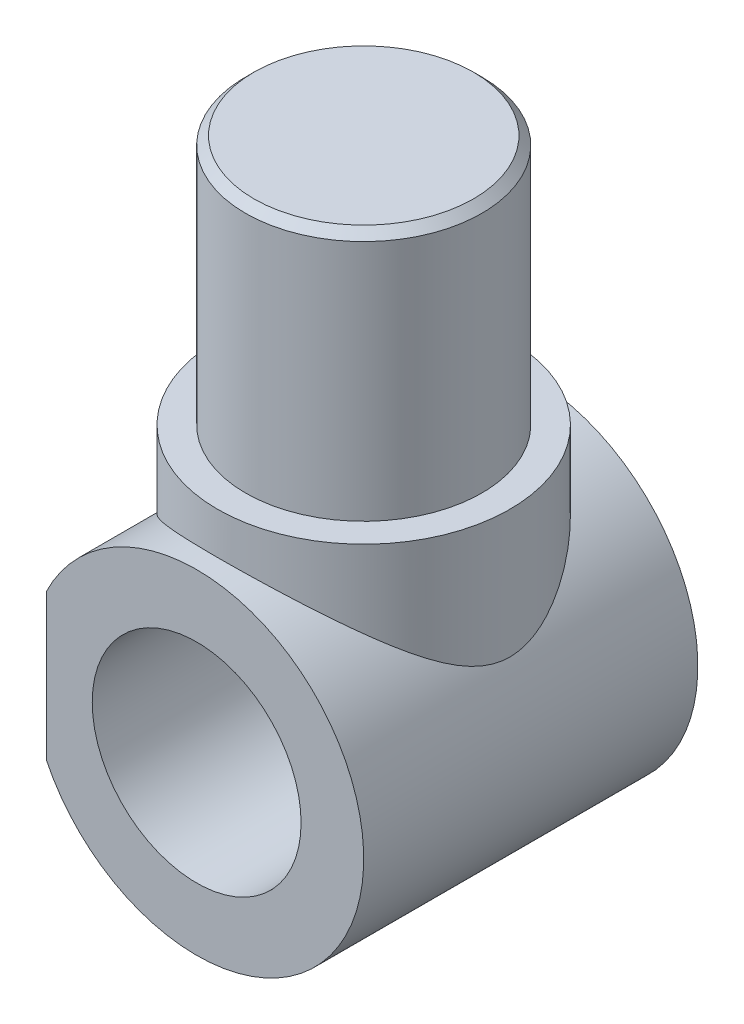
ISO-10303-21;
HEADER;
FILE_DESCRIPTION(('STEP AP214'),'2;1');
FILE_NAME('part.step','',(''),(''),'','','');
FILE_SCHEMA(('AUTOMOTIVE_DESIGN { 1 0 10303 214 1 1 1 1 }'));
ENDSEC;
DATA;
#1=APPLICATION_CONTEXT('core data for automotive mechanical design processes');
#2=APPLICATION_PROTOCOL_DEFINITION('international standard','automotive_design',2000,#1);
#3=PRODUCT_CONTEXT('',#1,'mechanical');
#4=PRODUCT('Part','Part','',(#3));
#5=PRODUCT_RELATED_PRODUCT_CATEGORY('part','',(#4));
#6=PRODUCT_DEFINITION_FORMATION('','',#4);
#7=PRODUCT_DEFINITION_CONTEXT('part definition',#1,'design');
#8=PRODUCT_DEFINITION('design','',#6,#7);
#9=PRODUCT_DEFINITION_SHAPE('','',#8);
#10=(LENGTH_UNIT() NAMED_UNIT(*) SI_UNIT(.MILLI.,.METRE.));
#11=(NAMED_UNIT(*) PLANE_ANGLE_UNIT() SI_UNIT($,.RADIAN.));
#12=(NAMED_UNIT(*) SI_UNIT($,.STERADIAN.) SOLID_ANGLE_UNIT());
#13=UNCERTAINTY_MEASURE_WITH_UNIT(LENGTH_MEASURE(1.E-05),#10,'distance_accuracy_value','');
#14=(GEOMETRIC_REPRESENTATION_CONTEXT(3) GLOBAL_UNCERTAINTY_ASSIGNED_CONTEXT((#13)) GLOBAL_UNIT_ASSIGNED_CONTEXT((#10,
#11,#12)) REPRESENTATION_CONTEXT('',''));
#15=CARTESIAN_POINT('',(0.,0.,0.));
#16=DIRECTION('',(0.,0.,1.));
#17=DIRECTION('',(1.,0.,0.));
#18=AXIS2_PLACEMENT_3D('',#15,#16,#17);
#19=CARTESIAN_POINT('',(0.,0.,20.));
#20=DIRECTION('',(0.,0.,1.));
#21=DIRECTION('',(1.,0.,0.));
#22=AXIS2_PLACEMENT_3D('',#19,#20,#21);
#23=PLANE('',#22);
#24=DIRECTION('',(0.,1.,0.));
#25=VECTOR('',#24,1.);
#26=CARTESIAN_POINT('',(-18.,10.,20.));
#27=LINE('',#26,#25);
#28=CARTESIAN_POINT('',(-18.,-8.71779788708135,20.));
#29=VERTEX_POINT('',#28);
#30=CARTESIAN_POINT('',(-18.,8.71779788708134,20.));
#31=VERTEX_POINT('',#30);
#32=EDGE_CURVE('E47',#29,#31,#27,.T.);
#33=ORIENTED_EDGE('',*,*,#32,.F.);
#34=CARTESIAN_POINT('',(0.,0.,20.));
#35=DIRECTION('',(0.,0.,1.));
#36=DIRECTION('',(1.,0.,0.));
#37=AXIS2_PLACEMENT_3D('',#34,#35,#36);
#38=CIRCLE('',#37,20.);
#39=EDGE_CURVE('E64',#29,#31,#38,.T.);
#40=ORIENTED_EDGE('',*,*,#39,.T.);
#41=EDGE_LOOP('',(#33,#40));
#42=FACE_BOUND('',#41,.T.);
#43=CARTESIAN_POINT('',(0.,0.,20.));
#44=DIRECTION('',(0.,0.,1.));
#45=DIRECTION('',(1.,0.,0.));
#46=AXIS2_PLACEMENT_3D('',#43,#44,#45);
#47=CIRCLE('',#46,12.5);
#48=CARTESIAN_POINT('',(12.5,0.,20.));
#49=VERTEX_POINT('',#48);
#50=EDGE_CURVE('E72',#49,#49,#47,.T.);
#51=ORIENTED_EDGE('',*,*,#50,.F.);
#52=EDGE_LOOP('',(#51));
#53=FACE_BOUND('',#52,.T.);
#54=ADVANCED_FACE('F32',(#42,#53),#23,.T.);
#55=CARTESIAN_POINT('',(0.,0.,-20.));
#56=DIRECTION('',(0.,0.,1.));
#57=DIRECTION('',(1.,0.,0.));
#58=AXIS2_PLACEMENT_3D('',#55,#56,#57);
#59=PLANE('',#58);
#60=CARTESIAN_POINT('',(0.,0.,-20.));
#61=DIRECTION('',(0.,0.,1.));
#62=DIRECTION('',(1.,0.,0.));
#63=AXIS2_PLACEMENT_3D('',#60,#61,#62);
#64=CIRCLE('',#63,20.);
#65=CARTESIAN_POINT('',(-18.,-8.71779788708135,-20.));
#66=VERTEX_POINT('',#65);
#67=CARTESIAN_POINT('',(-18.,8.71779788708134,-20.));
#68=VERTEX_POINT('',#67);
#69=EDGE_CURVE('E67',#66,#68,#64,.T.);
#70=ORIENTED_EDGE('',*,*,#69,.F.);
#71=DIRECTION('',(0.,1.,0.));
#72=VECTOR('',#71,1.);
#73=CARTESIAN_POINT('',(-18.,10.,-20.));
#74=LINE('',#73,#72);
#75=EDGE_CURVE('E56',#66,#68,#74,.T.);
#76=ORIENTED_EDGE('',*,*,#75,.T.);
#77=EDGE_LOOP('',(#70,#76));
#78=FACE_BOUND('',#77,.T.);
#79=CARTESIAN_POINT('',(0.,0.,-20.));
#80=DIRECTION('',(0.,0.,1.));
#81=DIRECTION('',(1.,0.,0.));
#82=AXIS2_PLACEMENT_3D('',#79,#80,#81);
#83=CIRCLE('',#82,12.5);
#84=CARTESIAN_POINT('',(12.5,0.,-20.));
#85=VERTEX_POINT('',#84);
#86=EDGE_CURVE('E126',#85,#85,#83,.T.);
#87=ORIENTED_EDGE('',*,*,#86,.T.);
#88=EDGE_LOOP('',(#87));
#89=FACE_BOUND('',#88,.T.);
#90=ADVANCED_FACE('F104',(#78,#89),#59,.F.);
#91=CARTESIAN_POINT('',(0.,0.,20.));
#92=DIRECTION('',(0.,0.,-1.));
#93=DIRECTION('',(-1.,0.,0.));
#94=AXIS2_PLACEMENT_3D('',#91,#92,#93);
#95=CYLINDRICAL_SURFACE('',#94,20.);
#96=CARTESIAN_POINT('',(0.,20.,17.5));
#97=CARTESIAN_POINT('',(0.409310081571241,20.0000043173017,17.5000043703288));
#98=CARTESIAN_POINT('',(0.81857181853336,19.9874130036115,17.4856188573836));
#99=CARTESIAN_POINT('',(1.63371360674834,19.9373449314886,17.428365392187));
#100=CARTESIAN_POINT('',(2.03959248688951,19.8998598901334,17.3854879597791));
#101=CARTESIAN_POINT('',(2.84495519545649,19.8007848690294,17.271995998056));
#102=CARTESIAN_POINT('',(3.24443051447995,19.739165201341,17.2013473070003));
#103=CARTESIAN_POINT('',(4.03348452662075,19.5931618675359,17.0336049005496));
#104=CARTESIAN_POINT('',(4.42306380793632,19.5087795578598,16.9365127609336));
#105=CARTESIAN_POINT('',(5.18734779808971,19.3195605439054,16.7182045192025));
#106=CARTESIAN_POINT('',(5.5621332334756,19.2148614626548,16.5971506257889));
#107=CARTESIAN_POINT('',(6.29757814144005,18.9865422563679,16.3322776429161));
#108=CARTESIAN_POINT('',(6.6582377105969,18.8629222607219,16.188458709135));
#109=CARTESIAN_POINT('',(7.36399894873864,18.5987498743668,15.8798571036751));
#110=CARTESIAN_POINT('',(7.70910095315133,18.4581978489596,15.715074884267));
#111=CARTESIAN_POINT('',(8.38281370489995,18.1621555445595,15.3662745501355));
#112=CARTESIAN_POINT('',(8.71142079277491,18.0066619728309,15.1822521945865));
#113=CARTESIAN_POINT('',(9.47545139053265,17.6199703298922,14.721904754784));
#114=CARTESIAN_POINT('',(9.90295999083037,17.3827741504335,14.4374321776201));
#115=CARTESIAN_POINT('',(10.7241338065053,16.8885404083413,13.8384055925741));
#116=CARTESIAN_POINT('',(11.1177867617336,16.6314957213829,13.5238407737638));
#117=CARTESIAN_POINT('',(11.8718925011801,16.101891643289,12.8669653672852));
#118=CARTESIAN_POINT('',(12.2322661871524,15.8292976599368,12.5245921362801));
#119=CARTESIAN_POINT('',(12.9189520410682,15.2740176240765,11.8150097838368));
#120=CARTESIAN_POINT('',(13.245268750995,14.9913329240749,11.4478039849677));
#121=CARTESIAN_POINT('',(13.8709259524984,14.4146539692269,10.6816356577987));
#122=CARTESIAN_POINT('',(14.1695316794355,14.1205473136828,10.2821585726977));
#123=CARTESIAN_POINT('',(14.7319137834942,13.532778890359,9.45882545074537));
#124=CARTESIAN_POINT('',(14.9956791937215,13.2391172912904,9.03496179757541));
#125=CARTESIAN_POINT('',(15.4875688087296,12.6601412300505,8.16304947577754));
#126=CARTESIAN_POINT('',(15.7157616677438,12.3748115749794,7.71504969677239));
#127=CARTESIAN_POINT('',(16.1360267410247,11.8215430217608,6.79231309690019));
#128=CARTESIAN_POINT('',(16.3281264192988,11.5535910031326,6.31759696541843));
#129=CARTESIAN_POINT('',(16.5900333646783,11.171205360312,5.5760316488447));
#130=CARTESIAN_POINT('',(16.6739706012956,11.0453363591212,5.32001317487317));
#131=CARTESIAN_POINT('',(16.8311299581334,10.8043372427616,4.79968230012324));
#132=CARTESIAN_POINT('',(16.9043516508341,10.6892075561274,4.53536956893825));
#133=CARTESIAN_POINT('',(17.03927411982,10.4727930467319,3.99869568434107));
#134=CARTESIAN_POINT('',(17.1009917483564,10.37148803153,3.72634699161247));
#135=CARTESIAN_POINT('',(17.2121601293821,10.1859341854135,3.17347969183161));
#136=CARTESIAN_POINT('',(17.2616155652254,10.1016788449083,2.89296424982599));
#137=CARTESIAN_POINT('',(17.3407113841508,9.96518782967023,2.36830260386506));
#138=CARTESIAN_POINT('',(17.3722302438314,9.91001953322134,2.1252065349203));
#139=CARTESIAN_POINT('',(17.425218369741,9.81655062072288,1.63478947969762));
#140=CARTESIAN_POINT('',(17.4466926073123,9.77824166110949,1.3874706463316));
#141=CARTESIAN_POINT('',(17.4791148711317,9.7201678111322,0.890241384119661));
#142=CARTESIAN_POINT('',(17.4900749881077,9.70038162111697,0.64033426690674));
#143=CARTESIAN_POINT('',(17.5012364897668,9.68023037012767,0.139486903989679));
#144=CARTESIAN_POINT('',(17.5014379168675,9.67986523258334,-0.11145333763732));
#145=CARTESIAN_POINT('',(17.4910766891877,9.69857437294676,-0.612370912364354));
#146=CARTESIAN_POINT('',(17.4805141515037,9.71764843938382,-0.862348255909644));
#147=CARTESIAN_POINT('',(17.448891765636,9.77431406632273,-1.35949833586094));
#148=CARTESIAN_POINT('',(17.427831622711,9.81190614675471,-1.60667099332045));
#149=CARTESIAN_POINT('',(17.3756436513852,9.90402925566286,-2.09712557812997));
#150=CARTESIAN_POINT('',(17.344500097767,9.95858673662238,-2.34040080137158));
#151=CARTESIAN_POINT('',(17.2727255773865,10.0825630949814,-2.82173892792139));
#152=CARTESIAN_POINT('',(17.2320912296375,10.1519872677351,-3.05979994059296));
#153=CARTESIAN_POINT('',(17.1147438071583,10.3491760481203,-3.6718974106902));
#154=CARTESIAN_POINT('',(17.0310468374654,10.4868834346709,-4.04140613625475));
#155=CARTESIAN_POINT('',(16.8429306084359,10.786425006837,-4.76504901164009));
#156=CARTESIAN_POINT('',(16.7384974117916,10.9482754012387,-5.11917262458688));
#157=CARTESIAN_POINT('',(16.5101165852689,11.2897476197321,-5.81378986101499));
#158=CARTESIAN_POINT('',(16.3861020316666,11.4694295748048,-6.1542315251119));
#159=CARTESIAN_POINT('',(16.1198996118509,11.8406510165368,-6.82112423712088));
#160=CARTESIAN_POINT('',(15.9777136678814,12.0321892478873,-7.14757675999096));
#161=CARTESIAN_POINT('',(15.7054064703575,12.3846537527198,-7.7247037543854));
#162=CARTESIAN_POINT('',(15.578385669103,12.5442188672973,-7.97768623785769));
#163=CARTESIAN_POINT('',(15.3131866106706,12.8666205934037,-8.47560407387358));
#164=CARTESIAN_POINT('',(15.1750072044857,13.0294575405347,-8.7205385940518));
#165=CARTESIAN_POINT('',(14.7437691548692,13.5207600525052,-9.44387555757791));
#166=CARTESIAN_POINT('',(14.4340769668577,13.8519299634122,-9.9106715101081));
#167=CARTESIAN_POINT('',(13.7709397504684,14.5113743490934,-10.8131561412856));
#168=CARTESIAN_POINT('',(13.4175392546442,14.8396514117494,-11.2488757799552));
#169=CARTESIAN_POINT('',(12.66635234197,15.4857603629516,-12.0884462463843));
#170=CARTESIAN_POINT('',(12.2685859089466,15.8035968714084,-12.4923112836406));
#171=CARTESIAN_POINT('',(11.5236983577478,16.3513589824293,-13.1775945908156));
#172=CARTESIAN_POINT('',(11.1855959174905,16.5848544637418,-13.4659887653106));
#173=CARTESIAN_POINT('',(10.4825372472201,17.0379355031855,-14.0202260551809));
#174=CARTESIAN_POINT('',(10.1175816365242,17.2575213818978,-14.2860696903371));
#175=CARTESIAN_POINT('',(9.36167408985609,17.6789723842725,-14.7924205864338));
#176=CARTESIAN_POINT('',(8.97075936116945,17.8808619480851,-15.0329628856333));
#177=CARTESIAN_POINT('',(8.16333251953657,18.2636105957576,-15.486258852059));
#178=CARTESIAN_POINT('',(7.74682568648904,18.4444739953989,-15.6990182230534));
#179=CARTESIAN_POINT('',(6.97073127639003,18.749625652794,-16.056318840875));
#180=CARTESIAN_POINT('',(6.61524010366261,18.8781487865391,-16.206156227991));
#181=CARTESIAN_POINT('',(5.88978506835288,19.1169080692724,-16.4836639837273));
#182=CARTESIAN_POINT('',(5.51982420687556,19.2271479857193,-16.6113389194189));
#183=CARTESIAN_POINT('',(4.76726960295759,19.4274209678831,-16.8427445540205));
#184=CARTESIAN_POINT('',(4.3846801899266,19.5174608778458,-16.9464833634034));
#185=CARTESIAN_POINT('',(3.60900842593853,19.6756627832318,-17.1284479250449));
#186=CARTESIAN_POINT('',(3.21592595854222,19.7438245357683,-17.20667339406));
#187=CARTESIAN_POINT('',(2.41987100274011,19.8571577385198,-17.3366008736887));
#188=CARTESIAN_POINT('',(2.016856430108,19.9022024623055,-17.3881566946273));
#189=CARTESIAN_POINT('',(1.20621871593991,19.9677334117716,-17.4631242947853));
#190=CARTESIAN_POINT('',(0.798595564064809,19.988219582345,-17.4865360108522));
#191=CARTESIAN_POINT('',(-0.0177076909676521,20.0041573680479,-17.5047516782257));
#192=CARTESIAN_POINT('',(-0.426387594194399,19.9996134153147,-17.4995606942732));
#193=CARTESIAN_POINT('',(-1.24132609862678,19.9656056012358,-17.4606843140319));
#194=CARTESIAN_POINT('',(-1.64758483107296,19.9361431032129,-17.4270004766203));
#195=CARTESIAN_POINT('',(-2.41934317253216,19.8565863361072,-17.3359298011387));
#196=CARTESIAN_POINT('',(-2.7853269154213,19.8084987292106,-17.2808471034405));
#197=CARTESIAN_POINT('',(-3.51008378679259,19.6929924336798,-17.1483237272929));
#198=CARTESIAN_POINT('',(-3.86885742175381,19.6255751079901,-17.070884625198));
#199=CARTESIAN_POINT('',(-4.57722430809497,19.4725540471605,-16.8947406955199));
#200=CARTESIAN_POINT('',(-4.92681597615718,19.3869471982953,-16.7960322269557));
#201=CARTESIAN_POINT('',(-5.61507990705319,19.1989107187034,-16.5786352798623));
#202=CARTESIAN_POINT('',(-5.95375149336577,19.0964800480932,-16.4599455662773));
#203=CARTESIAN_POINT('',(-6.64099831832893,18.8689360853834,-16.1954191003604));
#204=CARTESIAN_POINT('',(-6.98872904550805,18.7427659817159,-16.0483002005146));
#205=CARTESIAN_POINT('',(-7.66901492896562,18.4748446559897,-15.7345653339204));
#206=CARTESIAN_POINT('',(-8.00156984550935,18.3330931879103,-15.5679490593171));
#207=CARTESIAN_POINT('',(-8.65064537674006,18.0359008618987,-15.2168479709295));
#208=CARTESIAN_POINT('',(-8.96716818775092,17.8804618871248,-15.032365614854));
#209=CARTESIAN_POINT('',(-9.58375657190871,17.5576982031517,-14.6469738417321));
#210=CARTESIAN_POINT('',(-9.88381872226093,17.3903710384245,-14.4460610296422));
#211=CARTESIAN_POINT('',(-10.6172602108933,16.9569151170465,-13.9218746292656));
#212=CARTESIAN_POINT('',(-11.039831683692,16.6842336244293,-13.588815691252));
#213=CARTESIAN_POINT('',(-11.8463443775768,16.1216034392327,-12.8917988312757));
#214=CARTESIAN_POINT('',(-12.2302679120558,15.8316469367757,-12.5278269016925));
#215=CARTESIAN_POINT('',(-12.9614454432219,15.2388790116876,-11.7698599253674));
#216=CARTESIAN_POINT('',(-13.3085076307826,14.936010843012,-11.3757246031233));
#217=CARTESIAN_POINT('',(-13.9640591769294,14.3250058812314,-10.5607085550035));
#218=CARTESIAN_POINT('',(-14.27255791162,14.0168703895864,-10.1398343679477));
#219=CARTESIAN_POINT('',(-14.8580392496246,13.3949589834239,-9.26141456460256));
#220=CARTESIAN_POINT('',(-15.134130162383,13.0812170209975,-8.80324677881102));
#221=CARTESIAN_POINT('',(-15.5179948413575,12.6187236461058,-8.09407620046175));
#222=CARTESIAN_POINT('',(-15.6409672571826,12.4658257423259,-7.85388652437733));
#223=CARTESIAN_POINT('',(-15.876607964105,12.1642869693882,-7.36591807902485));
#224=CARTESIAN_POINT('',(-15.989277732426,12.0156454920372,-7.11814040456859));
#225=CARTESIAN_POINT('',(-16.2033681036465,11.7253223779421,-6.61625282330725));
#226=CARTESIAN_POINT('',(-16.3048577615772,11.5836014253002,-6.3621952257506));
#227=CARTESIAN_POINT('',(-16.4970763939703,11.3081681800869,-5.84571678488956));
#228=CARTESIAN_POINT('',(-16.5878039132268,11.1744569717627,-5.58329481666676));
#229=CARTESIAN_POINT('',(-16.7577981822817,10.9178679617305,-5.05018162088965));
#230=CARTESIAN_POINT('',(-16.8370854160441,10.7949709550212,-4.77950625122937));
#231=CARTESIAN_POINT('',(-16.9836515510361,10.5628789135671,-4.22925343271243));
#232=CARTESIAN_POINT('',(-17.050935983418,10.4536775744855,-3.94968015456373));
#233=CARTESIAN_POINT('',(-17.1642334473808,10.266419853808,-3.42078724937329));
#234=CARTESIAN_POINT('',(-17.2119003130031,10.1861451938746,-3.1726124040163));
#235=CARTESIAN_POINT('',(-17.2969865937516,10.0409832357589,-2.67005175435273));
#236=CARTESIAN_POINT('',(-17.3344071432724,9.9760942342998,-2.4156666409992));
#237=CARTESIAN_POINT('',(-17.3982168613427,9.86439037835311,-1.90229936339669));
#238=CARTESIAN_POINT('',(-17.4246365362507,9.81752556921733,-1.64333201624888));
#239=CARTESIAN_POINT('',(-17.465978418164,9.74378798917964,-1.12162514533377));
#240=CARTESIAN_POINT('',(-17.4809010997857,9.71691439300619,-0.858885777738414));
#241=CARTESIAN_POINT('',(-17.4989072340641,9.68445177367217,-0.329816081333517));
#242=CARTESIAN_POINT('',(-17.5019069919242,9.67901321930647,-0.0634734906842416));
#243=CARTESIAN_POINT('',(-17.49574827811,9.69014075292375,0.468597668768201));
#244=CARTESIAN_POINT('',(-17.4865899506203,9.70670657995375,0.734326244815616));
#245=CARTESIAN_POINT('',(-17.4563498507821,9.76098352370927,1.26341206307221));
#246=CARTESIAN_POINT('',(-17.4352452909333,9.79873505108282,1.52676379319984));
#247=CARTESIAN_POINT('',(-17.381640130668,9.89350935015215,2.04877666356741));
#248=CARTESIAN_POINT('',(-17.3491375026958,9.9505355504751,2.30743696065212));
#249=CARTESIAN_POINT('',(-17.2608372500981,10.1031491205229,2.90380191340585));
#250=CARTESIAN_POINT('',(-17.2008879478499,10.2052532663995,3.23922196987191));
#251=CARTESIAN_POINT('',(-17.0636267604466,10.4331340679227,3.89821678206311));
#252=CARTESIAN_POINT('',(-16.9863071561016,10.5589212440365,4.22178619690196));
#253=CARTESIAN_POINT('',(-16.8154820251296,10.8289035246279,4.85780900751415));
#254=CARTESIAN_POINT('',(-16.721930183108,10.9731509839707,5.17022742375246));
#255=CARTESIAN_POINT('',(-16.5198679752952,11.275059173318,5.78344114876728));
#256=CARTESIAN_POINT('',(-16.4113578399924,11.4327196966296,6.08423663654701));
#257=CARTESIAN_POINT('',(-16.1958343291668,11.7356153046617,6.63476020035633));
#258=CARTESIAN_POINT('',(-16.0906207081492,11.8796281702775,6.88587397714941));
#259=CARTESIAN_POINT('',(-15.8698848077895,12.1729410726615,7.3803829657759));
#260=CARTESIAN_POINT('',(-15.7543610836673,12.322241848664,7.62377708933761));
#261=CARTESIAN_POINT('',(-15.3925479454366,12.7757095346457,8.34314021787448));
#262=CARTESIAN_POINT('',(-15.1310806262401,13.0853499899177,8.80812760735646));
#263=CARTESIAN_POINT('',(-14.5681708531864,13.709322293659,9.71090211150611));
#264=CARTESIAN_POINT('',(-14.2666741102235,14.0236599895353,10.1486510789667));
#265=CARTESIAN_POINT('',(-13.623933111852,14.648870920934,10.9964199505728));
#266=CARTESIAN_POINT('',(-13.2826986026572,14.9597449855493,11.4064466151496));
#267=CARTESIAN_POINT('',(-12.5471109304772,15.5823772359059,12.211794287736));
#268=CARTESIAN_POINT('',(-12.1512960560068,15.8937705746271,12.6060673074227));
#269=CARTESIAN_POINT('',(-11.3160065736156,16.498909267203,13.3609445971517));
#270=CARTESIAN_POINT('',(-10.8765215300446,16.792650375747,13.7215407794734));
#271=CARTESIAN_POINT('',(-9.9554904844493,17.354491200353,14.4036663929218));
#272=CARTESIAN_POINT('',(-9.47407718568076,17.6226665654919,14.7253118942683));
#273=CARTESIAN_POINT('',(-8.46936230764,18.1269205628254,15.3251952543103));
#274=CARTESIAN_POINT('',(-7.94609165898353,18.3630225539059,15.6034647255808));
#275=CARTESIAN_POINT('',(-7.05828187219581,18.7168072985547,16.0179860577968));
#276=CARTESIAN_POINT('',(-6.7052855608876,18.846314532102,16.1690655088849));
#277=CARTESIAN_POINT('',(-5.9847451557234,19.0873528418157,16.4493820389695));
#278=CARTESIAN_POINT('',(-5.61720280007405,19.1988860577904,16.5786217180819));
#279=CARTESIAN_POINT('',(-4.86992231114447,19.4018938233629,16.8132965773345));
#280=CARTESIAN_POINT('',(-4.49020674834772,19.4934032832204,16.9187731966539));
#281=CARTESIAN_POINT('',(-3.72029279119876,19.6548750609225,17.1045672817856));
#282=CARTESIAN_POINT('',(-3.3300974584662,19.7248435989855,17.1848920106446));
#283=CARTESIAN_POINT('',(-2.45471186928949,19.8547424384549,17.333852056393));
#284=CARTESIAN_POINT('',(-1.96755125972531,19.9090549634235,17.3960016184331));
#285=CARTESIAN_POINT('',(-0.986904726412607,19.9816856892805,17.4790781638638));
#286=CARTESIAN_POINT('',(-0.493417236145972,19.9999947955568,17.4999947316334));
#287=CARTESIAN_POINT('',(0.,20.,17.5));
#288=B_SPLINE_CURVE_WITH_KNOTS('',3,(#96,#97,#98,#99,#100,#101,#102,#103,#104,#105,#106,#107,
#108,#109,#110,#111,#112,#113,#114,#115,#116,#117,#118,#119,#120,#121,#122,#123,#124,#125,#126,
#127,#128,#129,#130,#131,#132,#133,#134,#135,#136,#137,#138,#139,#140,#141,#142,#143,#144,#145,
#146,#147,#148,#149,#150,#151,#152,#153,#154,#155,#156,#157,#158,#159,#160,#161,#162,#163,#164,
#165,#166,#167,#168,#169,#170,#171,#172,#173,#174,#175,#176,#177,#178,#179,#180,#181,#182,#183,
#184,#185,#186,#187,#188,#189,#190,#191,#192,#193,#194,#195,#196,#197,#198,#199,#200,#201,#202,
#203,#204,#205,#206,#207,#208,#209,#210,#211,#212,#213,#214,#215,#216,#217,#218,#219,#220,#221,
#222,#223,#224,#225,#226,#227,#228,#229,#230,#231,#232,#233,#234,#235,#236,#237,#238,#239,#240,
#241,#242,#243,#244,#245,#246,#247,#248,#249,#250,#251,#252,#253,#254,#255,#256,#257,#258,#259,
#260,#261,#262,#263,#264,#265,#266,#267,#268,#269,#270,#271,#272,#273,#274,#275,#276,#277,#278,
#279,#280,#281,#282,#283,#284,#285,#286,#287),.UNSPECIFIED.,.T.,.F.,(4,2,2,2,2,2,2,2,2,2,2,2,2,
2,2,2,2,2,2,2,2,2,2,2,2,2,2,2,2,2,2,2,2,2,2,2,2,2,2,2,2,2,2,2,2,2,2,2,2,2,2,2,2,2,2,2,2,2,2,2,2,
2,2,2,2,2,2,2,2,2,2,2,2,2,2,2,2,2,2,2,2,2,2,2,2,2,2,2,2,2,2,2,2,2,2,4),(0.,1.2274053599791,
2.45521932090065,3.68454838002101,4.91380419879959,6.13500687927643,7.35620120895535,
8.57736919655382,9.79880691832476,11.4932530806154,13.1883102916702,14.8872978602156,
16.5860585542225,18.3215055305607,20.057497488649,21.7900963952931,23.5213715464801,
24.4131079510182,25.3048799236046,26.1953350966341,27.0854496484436,27.8385169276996,
28.5912110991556,29.3430386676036,30.0948632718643,30.8466796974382,31.5985172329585,
32.3515329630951,33.1048173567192,34.3121317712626,35.5202604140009,36.732611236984,
37.9448339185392,38.9193800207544,39.8940266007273,41.8438512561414,43.7917054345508,
45.7386857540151,47.2434221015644,48.7481237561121,50.250713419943,51.7529941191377,
52.9717012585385,54.1901569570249,55.4081991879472,56.6262549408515,57.850918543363,
59.0755848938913,60.3000343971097,61.5244169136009,62.6428157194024,63.761135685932,
64.8796472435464,65.9982279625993,67.1913663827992,68.3845236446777,69.5775170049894,
70.7707575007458,72.5777163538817,74.385498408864,76.2022686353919,78.0185962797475,
79.8768433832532,80.8070514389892,81.7371259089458,82.6610887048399,83.5851762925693,
84.5075881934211,85.4295739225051,86.2244123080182,87.0191626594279,87.8116941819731,
88.6041929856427,89.4022451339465,90.2002878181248,90.9998579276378,91.7995703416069,
92.8649317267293,93.9307674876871,94.9996959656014,96.068607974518,96.9922887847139,
97.9160992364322,99.7643098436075,101.615053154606,103.465343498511,105.381706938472,
107.298529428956,109.209491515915,111.119054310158,112.333623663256,113.54804831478,
114.76033851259,115.972278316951,117.451523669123,118.931142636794),.UNSPECIFIED.);
#289=CARTESIAN_POINT('',(0.,20.,17.5));
#290=VERTEX_POINT('',#289);
#291=EDGE_CURVE('E128',#290,#290,#288,.T.);
#292=ORIENTED_EDGE('',*,*,#291,.F.);
#293=EDGE_LOOP('',(#292));
#294=FACE_BOUND('',#293,.T.);
#295=ORIENTED_EDGE('',*,*,#39,.F.);
#296=DIRECTION('',(0.,0.,-1.));
#297=VECTOR('',#296,1.);
#298=CARTESIAN_POINT('',(-18.,-8.71779788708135,20.));
#299=LINE('',#298,#297);
#300=EDGE_CURVE('E11',#29,#66,#299,.T.);
#301=ORIENTED_EDGE('',*,*,#300,.T.);
#302=ORIENTED_EDGE('',*,*,#69,.T.);
#303=DIRECTION('',(0.,0.,-1.));
#304=VECTOR('',#303,1.);
#305=CARTESIAN_POINT('',(-18.,8.71779788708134,20.));
#306=LINE('',#305,#304);
#307=EDGE_CURVE('E40',#68,#31,#306,.F.);
#308=ORIENTED_EDGE('',*,*,#307,.T.);
#309=EDGE_LOOP('',(#295,#301,#302,#308));
#310=FACE_BOUND('',#309,.T.);
#311=ADVANCED_FACE('F34',(#294,#310),#95,.T.);
#312=CARTESIAN_POINT('',(0.,0.,20.));
#313=DIRECTION('',(0.,0.,-1.));
#314=DIRECTION('',(-1.,0.,0.));
#315=AXIS2_PLACEMENT_3D('',#312,#313,#314);
#316=CYLINDRICAL_SURFACE('',#315,12.5);
#317=ORIENTED_EDGE('',*,*,#50,.T.);
#318=EDGE_LOOP('',(#317));
#319=FACE_BOUND('',#318,.T.);
#320=ORIENTED_EDGE('',*,*,#86,.F.);
#321=EDGE_LOOP('',(#320));
#322=FACE_BOUND('',#321,.T.);
#323=ADVANCED_FACE('F111',(#319,#322),#316,.F.);
#324=CARTESIAN_POINT('',(0.,25.,0.));
#325=DIRECTION('',(0.,1.,0.));
#326=DIRECTION('',(0.,0.,1.));
#327=AXIS2_PLACEMENT_3D('',#324,#325,#326);
#328=PLANE('',#327);
#329=CARTESIAN_POINT('',(0.,25.,0.));
#330=DIRECTION('',(0.,1.,0.));
#331=DIRECTION('',(0.,0.,1.));
#332=AXIS2_PLACEMENT_3D('',#329,#330,#331);
#333=CIRCLE('',#332,14.142135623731);
#334=CARTESIAN_POINT('',(0.,25.,14.142135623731));
#335=VERTEX_POINT('',#334);
#336=EDGE_CURVE('E66',#335,#335,#333,.F.);
#337=ORIENTED_EDGE('',*,*,#336,.T.);
#338=EDGE_LOOP('',(#337));
#339=FACE_BOUND('',#338,.T.);
#340=CARTESIAN_POINT('',(0.,25.,0.));
#341=DIRECTION('',(0.,1.,0.));
#342=DIRECTION('',(0.,0.,1.));
#343=AXIS2_PLACEMENT_3D('',#340,#341,#342);
#344=CIRCLE('',#343,17.5);
#345=CARTESIAN_POINT('',(0.,25.,17.5));
#346=VERTEX_POINT('',#345);
#347=EDGE_CURVE('E131',#346,#346,#344,.T.);
#348=ORIENTED_EDGE('',*,*,#347,.T.);
#349=EDGE_LOOP('',(#348));
#350=FACE_BOUND('',#349,.T.);
#351=ADVANCED_FACE('F100',(#339,#350),#328,.T.);
#352=CARTESIAN_POINT('',(0.,-20.001,0.));
#353=DIRECTION('',(0.,1.,0.));
#354=DIRECTION('',(0.,0.,1.));
#355=AXIS2_PLACEMENT_3D('',#352,#353,#354);
#356=CYLINDRICAL_SURFACE('',#355,17.5);
#357=ORIENTED_EDGE('',*,*,#347,.F.);
#358=EDGE_LOOP('',(#357));
#359=FACE_BOUND('',#358,.T.);
#360=ORIENTED_EDGE('',*,*,#291,.T.);
#361=EDGE_LOOP('',(#360));
#362=FACE_BOUND('',#361,.T.);
#363=ADVANCED_FACE('F93',(#359,#362),#356,.T.);
#364=CARTESIAN_POINT('',(0.,55.,0.));
#365=DIRECTION('',(0.,1.,0.));
#366=DIRECTION('',(0.,0.,1.));
#367=AXIS2_PLACEMENT_3D('',#364,#365,#366);
#368=PLANE('',#367);
#369=CARTESIAN_POINT('',(0.,55.,0.));
#370=DIRECTION('',(0.,1.,0.));
#371=DIRECTION('',(0.,0.,1.));
#372=AXIS2_PLACEMENT_3D('',#369,#370,#371);
#373=CIRCLE('',#372,13.1421356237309);
#374=CARTESIAN_POINT('',(0.,55.,13.1421356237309));
#375=VERTEX_POINT('',#374);
#376=EDGE_CURVE('E70',#375,#375,#373,.T.);
#377=ORIENTED_EDGE('',*,*,#376,.T.);
#378=EDGE_LOOP('',(#377));
#379=FACE_BOUND('',#378,.T.);
#380=ADVANCED_FACE('F91',(#379),#368,.T.);
#381=CARTESIAN_POINT('',(0.,-20.001,0.));
#382=DIRECTION('',(0.,1.,0.));
#383=DIRECTION('',(0.,0.,1.));
#384=AXIS2_PLACEMENT_3D('',#381,#382,#383);
#385=CYLINDRICAL_SURFACE('',#384,14.142135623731);
#386=CARTESIAN_POINT('',(0.,54.,0.));
#387=DIRECTION('',(0.,1.,0.));
#388=DIRECTION('',(0.,0.,1.));
#389=AXIS2_PLACEMENT_3D('',#386,#387,#388);
#390=CIRCLE('',#389,14.142135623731);
#391=CARTESIAN_POINT('',(0.,54.,14.142135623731));
#392=VERTEX_POINT('',#391);
#393=EDGE_CURVE('E78',#392,#392,#390,.F.);
#394=ORIENTED_EDGE('',*,*,#393,.T.);
#395=EDGE_LOOP('',(#394));
#396=FACE_BOUND('',#395,.T.);
#397=ORIENTED_EDGE('',*,*,#336,.F.);
#398=EDGE_LOOP('',(#397));
#399=FACE_BOUND('',#398,.T.);
#400=ADVANCED_FACE('F82',(#396,#399),#385,.T.);
#401=CARTESIAN_POINT('',(0.,55.,0.));
#402=DIRECTION('',(0.,-1.,0.));
#403=DIRECTION('',(0.,0.,-1.));
#404=AXIS2_PLACEMENT_3D('',#401,#402,#403);
#405=CONICAL_SURFACE('',#404,13.1421356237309,0.78539816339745);
#406=ORIENTED_EDGE('',*,*,#393,.F.);
#407=EDGE_LOOP('',(#406));
#408=FACE_BOUND('',#407,.T.);
#409=ORIENTED_EDGE('',*,*,#376,.F.);
#410=EDGE_LOOP('',(#409));
#411=FACE_BOUND('',#410,.T.);
#412=ADVANCED_FACE('F85',(#408,#411),#405,.T.);
#413=CARTESIAN_POINT('',(-18.,10.,-20.));
#414=DIRECTION('',(1.,0.,0.));
#415=DIRECTION('',(0.,1.,0.));
#416=AXIS2_PLACEMENT_3D('',#413,#414,#415);
#417=PLANE('',#416);
#418=ORIENTED_EDGE('',*,*,#32,.T.);
#419=ORIENTED_EDGE('',*,*,#307,.F.);
#420=ORIENTED_EDGE('',*,*,#75,.F.);
#421=ORIENTED_EDGE('',*,*,#300,.F.);
#422=EDGE_LOOP('',(#418,#419,#420,#421));
#423=FACE_BOUND('',#422,.T.);
#424=ADVANCED_FACE('F55',(#423),#417,.F.);
#425=CLOSED_SHELL('',(#54,#90,#311,#323,#351,#363,#380,#400,#412,#424));
#426=MANIFOLD_SOLID_BREP('B2',#425);
#427=ADVANCED_BREP_SHAPE_REPRESENTATION('',(#18,#426),#14);
#428=SHAPE_DEFINITION_REPRESENTATION(#9,#427);
ENDSEC;
END-ISO-10303-21;
